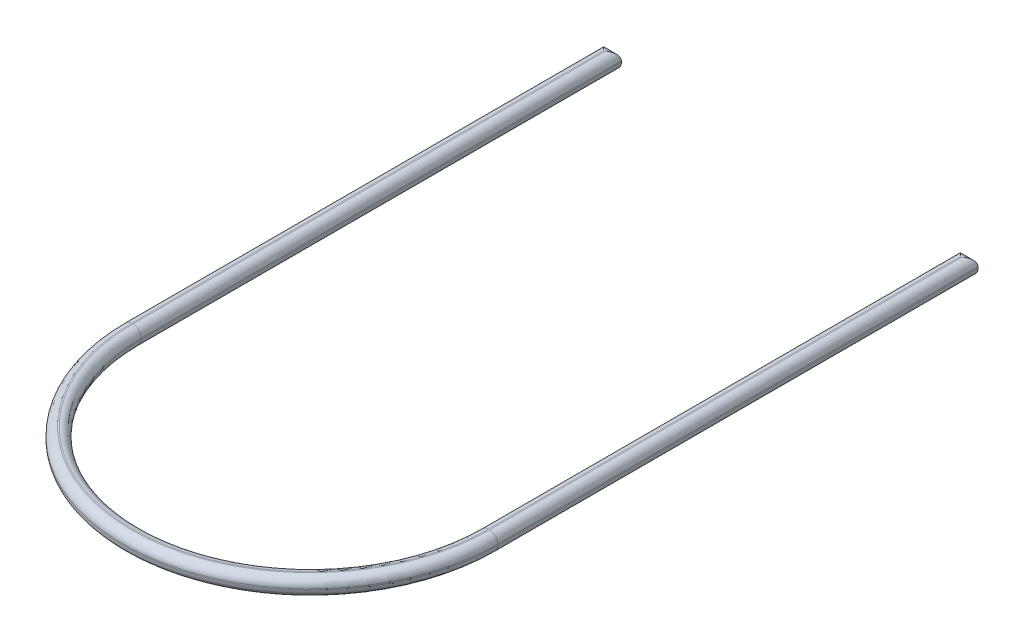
from build123d import *

# Parameters (mm, degrees)
BOSS_EXTRUDE1_DEPTH = 7.9375
FILLET1_R           = 3.683


with BuildPart() as part:
    # Sketch1 → Boss-Extrude1 (new body)
    with BuildSketch(Plane(origin=(0, 0, 0), x_dir=(1, 0, 0), z_dir=(0, 1, 0))):
        with BuildLine():
            Line((-84.1375, 0), (-84.1375, 215.9))
            Line((-84.1375, 215.9), (-76.2, 215.9))
            Line((-76.2, 215.9), (-76.2, 0))
            ThreePointArc((-76.2, 0), (0, -76.2), (76.2, 0))
            Line((76.2, 0), (76.2, 215.9))
            Line((76.2, 215.9), (84.1375, 215.9))
            Line((84.1375, 215.9), (84.1375, 0))
            ThreePointArc((84.1375, 0), (0, -84.1375), (-84.1375, 0))
        make_face()
    extrude(amount=-BOSS_EXTRUDE1_DEPTH)

    # Fillet1
    fillet1_edges = [part.edges().sort_by_distance(p)[0] for p in [
        (84.1375, 0, -107.95),
        (0, 0, 84.1375),
        (76.2, -7.9375, -107.95),
        (0, -7.9375, 76.2),
        (-76.2, -7.9375, -107.95),
        (-84.1375, -7.9375, -107.95),
        (0, -7.9375, 84.1375),
        (84.1375, -7.9375, -107.95),
        (-84.1375, 0, -107.95),
        (-80.16875, 0, -215.9),
        (-76.2, 0, -107.95),
        (0, 0, 76.2),
        (76.2, 0, -107.95),
        (80.16875, 0, -215.9),
    ]]
    fillet(fillet1_edges, radius=FILLET1_R)


solid = part.part
